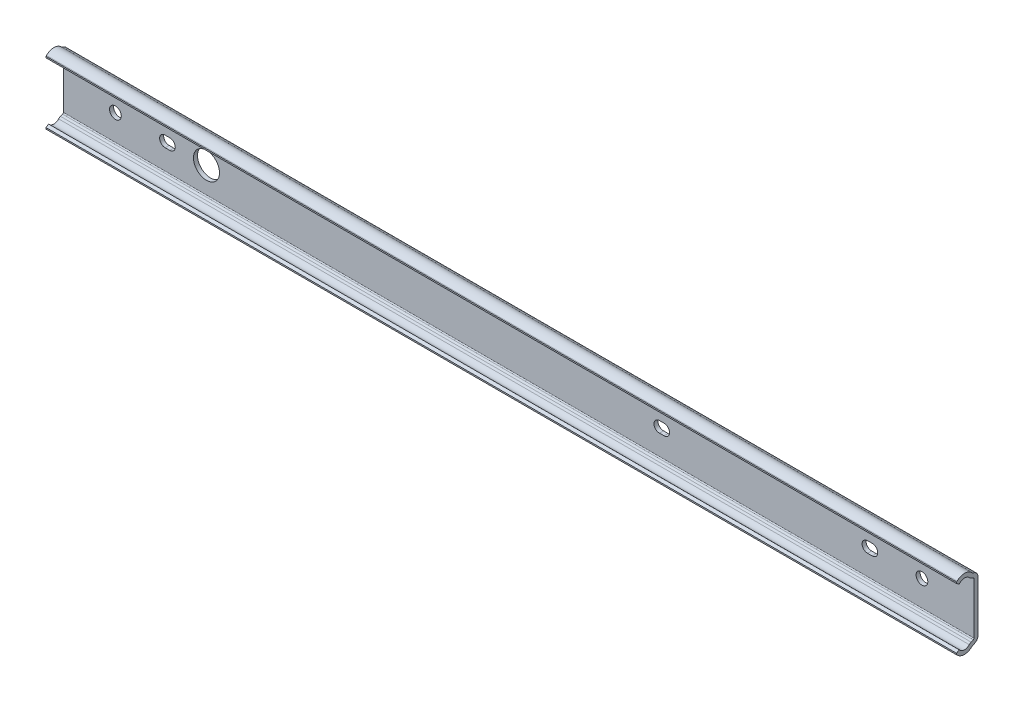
ISO-10303-21;
HEADER;
FILE_DESCRIPTION(('STEP AP214'),'2;1');
FILE_NAME('part.step','',(''),(''),'','','');
FILE_SCHEMA(('AUTOMOTIVE_DESIGN { 1 0 10303 214 1 1 1 1 }'));
ENDSEC;
DATA;
#1=APPLICATION_CONTEXT('core data for automotive mechanical design processes');
#2=APPLICATION_PROTOCOL_DEFINITION('international standard','automotive_design',2000,#1);
#3=PRODUCT_CONTEXT('',#1,'mechanical');
#4=PRODUCT('Part','Part','',(#3));
#5=PRODUCT_RELATED_PRODUCT_CATEGORY('part','',(#4));
#6=PRODUCT_DEFINITION_FORMATION('','',#4);
#7=PRODUCT_DEFINITION_CONTEXT('part definition',#1,'design');
#8=PRODUCT_DEFINITION('design','',#6,#7);
#9=PRODUCT_DEFINITION_SHAPE('','',#8);
#10=(LENGTH_UNIT() NAMED_UNIT(*) SI_UNIT(.MILLI.,.METRE.));
#11=(NAMED_UNIT(*) PLANE_ANGLE_UNIT() SI_UNIT($,.RADIAN.));
#12=(NAMED_UNIT(*) SI_UNIT($,.STERADIAN.) SOLID_ANGLE_UNIT());
#13=UNCERTAINTY_MEASURE_WITH_UNIT(LENGTH_MEASURE(1.E-05),#10,'distance_accuracy_value','');
#14=(GEOMETRIC_REPRESENTATION_CONTEXT(3) GLOBAL_UNCERTAINTY_ASSIGNED_CONTEXT((#13)) GLOBAL_UNIT_ASSIGNED_CONTEXT((#10,
#11,#12)) REPRESENTATION_CONTEXT('',''));
#15=CARTESIAN_POINT('',(0.,0.,0.));
#16=DIRECTION('',(0.,0.,1.));
#17=DIRECTION('',(1.,0.,0.));
#18=AXIS2_PLACEMENT_3D('',#15,#16,#17);
#19=CARTESIAN_POINT('',(-20.,-9.85313472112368,0.));
#20=DIRECTION('',(0.,0.,1.));
#21=DIRECTION('',(1.,0.,0.));
#22=AXIS2_PLACEMENT_3D('',#19,#20,#21);
#23=PLANE('',#22);
#24=DIRECTION('',(-1.,0.,0.));
#25=VECTOR('',#24,1.);
#26=CARTESIAN_POINT('',(-20.,2.09999977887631,0.));
#27=LINE('',#26,#25);
#28=CARTESIAN_POINT('',(290.9,2.09999977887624,0.));
#29=VERTEX_POINT('',#28);
#30=CARTESIAN_POINT('',(289.1,2.09999977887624,0.));
#31=VERTEX_POINT('',#30);
#32=EDGE_CURVE('E291',#29,#31,#27,.T.);
#33=ORIENTED_EDGE('',*,*,#32,.T.);
#34=CARTESIAN_POINT('',(289.1,-2.21123763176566E-07,0.));
#35=DIRECTION('',(0.,0.,1.));
#36=DIRECTION('',(1.,0.,0.));
#37=AXIS2_PLACEMENT_3D('',#34,#35,#36);
#38=CIRCLE('',#37,2.1);
#39=CARTESIAN_POINT('',(289.1,-2.10000022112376,0.));
#40=VERTEX_POINT('',#39);
#41=EDGE_CURVE('E294',#31,#40,#38,.T.);
#42=ORIENTED_EDGE('',*,*,#41,.T.);
#43=DIRECTION('',(1.,0.,0.));
#44=VECTOR('',#43,1.);
#45=CARTESIAN_POINT('',(-20.,-2.10000022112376,0.));
#46=LINE('',#45,#44);
#47=CARTESIAN_POINT('',(290.9,-2.10000022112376,0.));
#48=VERTEX_POINT('',#47);
#49=EDGE_CURVE('E286',#40,#48,#46,.T.);
#50=ORIENTED_EDGE('',*,*,#49,.T.);
#51=CARTESIAN_POINT('',(290.9,-2.21123763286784E-07,0.));
#52=DIRECTION('',(0.,0.,1.));
#53=DIRECTION('',(1.,0.,0.));
#54=AXIS2_PLACEMENT_3D('',#51,#52,#53);
#55=CIRCLE('',#54,2.1);
#56=EDGE_CURVE('E266',#48,#29,#55,.T.);
#57=ORIENTED_EDGE('',*,*,#56,.T.);
#58=EDGE_LOOP('',(#33,#42,#50,#57));
#59=FACE_BOUND('',#58,.T.);
#60=DIRECTION('',(1.,0.,0.));
#61=VECTOR('',#60,1.);
#62=CARTESIAN_POINT('',(-20.,-9.85313472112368,0.));
#63=LINE('',#62,#61);
#64=CARTESIAN_POINT('',(-20.,-9.85313472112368,0.));
#65=VERTEX_POINT('',#64);
#66=CARTESIAN_POINT('',(330.,-9.85313472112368,0.));
#67=VERTEX_POINT('',#66);
#68=EDGE_CURVE('E502',#65,#67,#63,.T.);
#69=ORIENTED_EDGE('',*,*,#68,.F.);
#70=DIRECTION('',(0.,-1.,0.));
#71=VECTOR('',#70,1.);
#72=CARTESIAN_POINT('',(-20.,-9.85313472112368,0.));
#73=LINE('',#72,#71);
#74=CARTESIAN_POINT('',(-20.,9.85313427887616,0.));
#75=VERTEX_POINT('',#74);
#76=EDGE_CURVE('E420',#75,#65,#73,.T.);
#77=ORIENTED_EDGE('',*,*,#76,.F.);
#78=DIRECTION('',(1.,0.,0.));
#79=VECTOR('',#78,1.);
#80=CARTESIAN_POINT('',(-20.,9.85313427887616,0.));
#81=LINE('',#80,#79);
#82=CARTESIAN_POINT('',(330.,9.85313427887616,0.));
#83=VERTEX_POINT('',#82);
#84=EDGE_CURVE('E505',#75,#83,#81,.T.);
#85=ORIENTED_EDGE('',*,*,#84,.T.);
#86=DIRECTION('',(0.,-1.,0.));
#87=VECTOR('',#86,1.);
#88=CARTESIAN_POINT('',(330.,-9.85313472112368,0.));
#89=LINE('',#88,#87);
#90=EDGE_CURVE('E367',#83,#67,#89,.T.);
#91=ORIENTED_EDGE('',*,*,#90,.T.);
#92=EDGE_LOOP('',(#69,#77,#85,#91));
#93=FACE_BOUND('',#92,.T.);
#94=CARTESIAN_POINT('',(35.,0.,0.));
#95=DIRECTION('',(0.,0.,-1.));
#96=DIRECTION('',(-1.,0.,0.));
#97=AXIS2_PLACEMENT_3D('',#94,#95,#96);
#98=CIRCLE('',#97,5.);
#99=CARTESIAN_POINT('',(30.,0.,0.));
#100=VERTEX_POINT('',#99);
#101=EDGE_CURVE('E297',#100,#100,#98,.T.);
#102=ORIENTED_EDGE('',*,*,#101,.F.);
#103=EDGE_LOOP('',(#102));
#104=FACE_BOUND('',#103,.T.);
#105=DIRECTION('',(-1.,0.,0.));
#106=VECTOR('',#105,1.);
#107=CARTESIAN_POINT('',(20.9,-2.1,0.));
#108=LINE('',#107,#106);
#109=CARTESIAN_POINT('',(20.9,-2.1,0.));
#110=VERTEX_POINT('',#109);
#111=CARTESIAN_POINT('',(19.1,-2.1,0.));
#112=VERTEX_POINT('',#111);
#113=EDGE_CURVE('E302',#110,#112,#108,.T.);
#114=ORIENTED_EDGE('',*,*,#113,.F.);
#115=CARTESIAN_POINT('',(20.9,0.,0.));
#116=DIRECTION('',(0.,0.,-1.));
#117=DIRECTION('',(-1.,0.,0.));
#118=AXIS2_PLACEMENT_3D('',#115,#116,#117);
#119=CIRCLE('',#118,2.1);
#120=CARTESIAN_POINT('',(20.9,2.1,0.));
#121=VERTEX_POINT('',#120);
#122=EDGE_CURVE('E300',#121,#110,#119,.T.);
#123=ORIENTED_EDGE('',*,*,#122,.F.);
#124=DIRECTION('',(1.,0.,0.));
#125=VECTOR('',#124,1.);
#126=CARTESIAN_POINT('',(20.9,2.1,0.));
#127=LINE('',#126,#125);
#128=CARTESIAN_POINT('',(19.1,2.1,0.));
#129=VERTEX_POINT('',#128);
#130=EDGE_CURVE('E308',#129,#121,#127,.T.);
#131=ORIENTED_EDGE('',*,*,#130,.F.);
#132=CARTESIAN_POINT('',(19.1,0.,0.));
#133=DIRECTION('',(0.,0.,-1.));
#134=DIRECTION('',(-1.,0.,0.));
#135=AXIS2_PLACEMENT_3D('',#132,#133,#134);
#136=CIRCLE('',#135,2.1);
#137=EDGE_CURVE('E305',#112,#129,#136,.T.);
#138=ORIENTED_EDGE('',*,*,#137,.F.);
#139=EDGE_LOOP('',(#114,#123,#131,#138));
#140=FACE_BOUND('',#139,.T.);
#141=DIRECTION('',(-1.,0.,0.));
#142=VECTOR('',#141,1.);
#143=CARTESIAN_POINT('',(210.9,-2.1,0.));
#144=LINE('',#143,#142);
#145=CARTESIAN_POINT('',(210.9,-2.1,0.));
#146=VERTEX_POINT('',#145);
#147=CARTESIAN_POINT('',(209.1,-2.1,0.));
#148=VERTEX_POINT('',#147);
#149=EDGE_CURVE('E322',#146,#148,#144,.T.);
#150=ORIENTED_EDGE('',*,*,#149,.F.);
#151=CARTESIAN_POINT('',(210.9,0.,0.));
#152=DIRECTION('',(0.,0.,-1.));
#153=DIRECTION('',(-1.,0.,0.));
#154=AXIS2_PLACEMENT_3D('',#151,#152,#153);
#155=CIRCLE('',#154,2.1);
#156=CARTESIAN_POINT('',(210.9,2.09999999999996,0.));
#157=VERTEX_POINT('',#156);
#158=EDGE_CURVE('E314',#157,#146,#155,.T.);
#159=ORIENTED_EDGE('',*,*,#158,.F.);
#160=DIRECTION('',(1.,0.,0.));
#161=VECTOR('',#160,1.);
#162=CARTESIAN_POINT('',(210.9,2.09999999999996,0.));
#163=LINE('',#162,#161);
#164=CARTESIAN_POINT('',(209.1,2.09999999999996,0.));
#165=VERTEX_POINT('',#164);
#166=EDGE_CURVE('E328',#165,#157,#163,.T.);
#167=ORIENTED_EDGE('',*,*,#166,.F.);
#168=CARTESIAN_POINT('',(209.1,0.,0.));
#169=DIRECTION('',(0.,0.,-1.));
#170=DIRECTION('',(-1.,0.,0.));
#171=AXIS2_PLACEMENT_3D('',#168,#169,#170);
#172=CIRCLE('',#171,2.1);
#173=EDGE_CURVE('E325',#148,#165,#172,.T.);
#174=ORIENTED_EDGE('',*,*,#173,.F.);
#175=EDGE_LOOP('',(#150,#159,#167,#174));
#176=FACE_BOUND('',#175,.T.);
#177=CARTESIAN_POINT('',(0.,0.,0.));
#178=DIRECTION('',(0.,0.,-1.));
#179=DIRECTION('',(-1.,0.,0.));
#180=AXIS2_PLACEMENT_3D('',#177,#178,#179);
#181=CIRCLE('',#180,2.24999999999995);
#182=CARTESIAN_POINT('',(-2.24999999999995,0.,0.));
#183=VERTEX_POINT('',#182);
#184=EDGE_CURVE('E334',#183,#183,#181,.T.);
#185=ORIENTED_EDGE('',*,*,#184,.F.);
#186=EDGE_LOOP('',(#185));
#187=FACE_BOUND('',#186,.T.);
#188=CARTESIAN_POINT('',(310.,0.,0.));
#189=DIRECTION('',(0.,0.,-1.));
#190=DIRECTION('',(-1.,0.,0.));
#191=AXIS2_PLACEMENT_3D('',#188,#189,#190);
#192=CIRCLE('',#191,2.25);
#193=CARTESIAN_POINT('',(307.75,0.,0.));
#194=VERTEX_POINT('',#193);
#195=EDGE_CURVE('E344',#194,#194,#192,.T.);
#196=ORIENTED_EDGE('',*,*,#195,.F.);
#197=EDGE_LOOP('',(#196));
#198=FACE_BOUND('',#197,.T.);
#199=ADVANCED_FACE('F14',(#59,#93,#104,#140,#176,#187,#198),#23,.F.);
#200=CARTESIAN_POINT('',(-20.,-9.85313472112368,1.54999999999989));
#201=DIRECTION('',(0.,0.,-1.));
#202=DIRECTION('',(-1.,0.,0.));
#203=AXIS2_PLACEMENT_3D('',#200,#201,#202);
#204=PLANE('',#203);
#205=DIRECTION('',(1.,0.,0.));
#206=VECTOR('',#205,1.);
#207=CARTESIAN_POINT('',(289.1,-2.10000022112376,1.54999999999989));
#208=LINE('',#207,#206);
#209=CARTESIAN_POINT('',(289.1,-2.10000022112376,1.54999999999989));
#210=VERTEX_POINT('',#209);
#211=CARTESIAN_POINT('',(290.9,-2.10000022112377,1.54999999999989));
#212=VERTEX_POINT('',#211);
#213=EDGE_CURVE('E272',#210,#212,#208,.T.);
#214=ORIENTED_EDGE('',*,*,#213,.F.);
#215=CARTESIAN_POINT('',(289.1,-2.21123763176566E-07,1.54999999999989));
#216=DIRECTION('',(0.,0.,1.));
#217=DIRECTION('',(1.,0.,0.));
#218=AXIS2_PLACEMENT_3D('',#215,#216,#217);
#219=CIRCLE('',#218,2.1);
#220=CARTESIAN_POINT('',(289.1,2.09999977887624,1.54999999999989));
#221=VERTEX_POINT('',#220);
#222=EDGE_CURVE('E38',#221,#210,#219,.T.);
#223=ORIENTED_EDGE('',*,*,#222,.F.);
#224=DIRECTION('',(-1.,0.,0.));
#225=VECTOR('',#224,1.);
#226=CARTESIAN_POINT('',(289.1,2.09999977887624,1.54999999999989));
#227=LINE('',#226,#225);
#228=CARTESIAN_POINT('',(290.9,2.09999977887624,1.54999999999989));
#229=VERTEX_POINT('',#228);
#230=EDGE_CURVE('E279',#229,#221,#227,.T.);
#231=ORIENTED_EDGE('',*,*,#230,.F.);
#232=CARTESIAN_POINT('',(290.9,-2.21123763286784E-07,1.54999999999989));
#233=DIRECTION('',(0.,0.,1.));
#234=DIRECTION('',(1.,0.,0.));
#235=AXIS2_PLACEMENT_3D('',#232,#233,#234);
#236=CIRCLE('',#235,2.1);
#237=EDGE_CURVE('E263',#212,#229,#236,.T.);
#238=ORIENTED_EDGE('',*,*,#237,.F.);
#239=EDGE_LOOP('',(#214,#223,#231,#238));
#240=FACE_BOUND('',#239,.T.);
#241=CARTESIAN_POINT('',(35.,0.,1.54999999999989));
#242=DIRECTION('',(0.,0.,-1.));
#243=DIRECTION('',(-1.,0.,0.));
#244=AXIS2_PLACEMENT_3D('',#241,#242,#243);
#245=CIRCLE('',#244,5.);
#246=CARTESIAN_POINT('',(30.,0.,1.54999999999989));
#247=VERTEX_POINT('',#246);
#248=EDGE_CURVE('E18',#247,#247,#245,.T.);
#249=ORIENTED_EDGE('',*,*,#248,.T.);
#250=EDGE_LOOP('',(#249));
#251=FACE_BOUND('',#250,.T.);
#252=DIRECTION('',(1.,0.,0.));
#253=VECTOR('',#252,1.);
#254=CARTESIAN_POINT('',(-20.,2.1,1.54999999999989));
#255=LINE('',#254,#253);
#256=CARTESIAN_POINT('',(19.1,2.1,1.54999999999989));
#257=VERTEX_POINT('',#256);
#258=CARTESIAN_POINT('',(20.9,2.1,1.54999999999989));
#259=VERTEX_POINT('',#258);
#260=EDGE_CURVE('E23',#257,#259,#255,.T.);
#261=ORIENTED_EDGE('',*,*,#260,.T.);
#262=CARTESIAN_POINT('',(20.9,0.,1.54999999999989));
#263=DIRECTION('',(0.,0.,-1.));
#264=DIRECTION('',(-1.,0.,0.));
#265=AXIS2_PLACEMENT_3D('',#262,#263,#264);
#266=CIRCLE('',#265,2.1);
#267=CARTESIAN_POINT('',(20.9,-2.1,1.54999999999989));
#268=VERTEX_POINT('',#267);
#269=EDGE_CURVE('E9',#259,#268,#266,.T.);
#270=ORIENTED_EDGE('',*,*,#269,.T.);
#271=DIRECTION('',(-1.,0.,0.));
#272=VECTOR('',#271,1.);
#273=CARTESIAN_POINT('',(-20.,-2.1,1.54999999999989));
#274=LINE('',#273,#272);
#275=CARTESIAN_POINT('',(19.1,-2.1,1.54999999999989));
#276=VERTEX_POINT('',#275);
#277=EDGE_CURVE('E548',#268,#276,#274,.T.);
#278=ORIENTED_EDGE('',*,*,#277,.T.);
#279=CARTESIAN_POINT('',(19.1,0.,1.54999999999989));
#280=DIRECTION('',(0.,0.,-1.));
#281=DIRECTION('',(-1.,0.,0.));
#282=AXIS2_PLACEMENT_3D('',#279,#280,#281);
#283=CIRCLE('',#282,2.1);
#284=EDGE_CURVE('E551',#276,#257,#283,.T.);
#285=ORIENTED_EDGE('',*,*,#284,.T.);
#286=EDGE_LOOP('',(#261,#270,#278,#285));
#287=FACE_BOUND('',#286,.T.);
#288=DIRECTION('',(1.,0.,0.));
#289=VECTOR('',#288,1.);
#290=CARTESIAN_POINT('',(-20.,2.09999999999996,1.54999999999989));
#291=LINE('',#290,#289);
#292=CARTESIAN_POINT('',(209.1,2.09999999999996,1.54999999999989));
#293=VERTEX_POINT('',#292);
#294=CARTESIAN_POINT('',(210.9,2.09999999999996,1.54999999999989));
#295=VERTEX_POINT('',#294);
#296=EDGE_CURVE('E542',#293,#295,#291,.T.);
#297=ORIENTED_EDGE('',*,*,#296,.T.);
#298=CARTESIAN_POINT('',(210.9,0.,1.54999999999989));
#299=DIRECTION('',(0.,0.,-1.));
#300=DIRECTION('',(-1.,0.,0.));
#301=AXIS2_PLACEMENT_3D('',#298,#299,#300);
#302=CIRCLE('',#301,2.1);
#303=CARTESIAN_POINT('',(210.9,-2.1,1.54999999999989));
#304=VERTEX_POINT('',#303);
#305=EDGE_CURVE('E545',#295,#304,#302,.T.);
#306=ORIENTED_EDGE('',*,*,#305,.T.);
#307=DIRECTION('',(-1.,0.,0.));
#308=VECTOR('',#307,1.);
#309=CARTESIAN_POINT('',(-20.,-2.1,1.54999999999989));
#310=LINE('',#309,#308);
#311=CARTESIAN_POINT('',(209.1,-2.1,1.54999999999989));
#312=VERTEX_POINT('',#311);
#313=EDGE_CURVE('E532',#304,#312,#310,.T.);
#314=ORIENTED_EDGE('',*,*,#313,.T.);
#315=CARTESIAN_POINT('',(209.1,0.,1.54999999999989));
#316=DIRECTION('',(0.,0.,-1.));
#317=DIRECTION('',(-1.,0.,0.));
#318=AXIS2_PLACEMENT_3D('',#315,#316,#317);
#319=CIRCLE('',#318,2.1);
#320=EDGE_CURVE('E539',#312,#293,#319,.T.);
#321=ORIENTED_EDGE('',*,*,#320,.T.);
#322=EDGE_LOOP('',(#297,#306,#314,#321));
#323=FACE_BOUND('',#322,.T.);
#324=CARTESIAN_POINT('',(0.,0.,1.54999999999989));
#325=DIRECTION('',(0.,0.,-1.));
#326=DIRECTION('',(-1.,0.,0.));
#327=AXIS2_PLACEMENT_3D('',#324,#325,#326);
#328=CIRCLE('',#327,2.24999999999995);
#329=CARTESIAN_POINT('',(-2.24999999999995,0.,1.54999999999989));
#330=VERTEX_POINT('',#329);
#331=EDGE_CURVE('E343',#330,#330,#328,.T.);
#332=ORIENTED_EDGE('',*,*,#331,.T.);
#333=EDGE_LOOP('',(#332));
#334=FACE_BOUND('',#333,.T.);
#335=CARTESIAN_POINT('',(310.,0.,1.54999999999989));
#336=DIRECTION('',(0.,0.,-1.));
#337=DIRECTION('',(-1.,0.,0.));
#338=AXIS2_PLACEMENT_3D('',#335,#336,#337);
#339=CIRCLE('',#338,2.25);
#340=CARTESIAN_POINT('',(307.75,0.,1.54999999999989));
#341=VERTEX_POINT('',#340);
#342=EDGE_CURVE('E347',#341,#341,#339,.T.);
#343=ORIENTED_EDGE('',*,*,#342,.T.);
#344=EDGE_LOOP('',(#343));
#345=FACE_BOUND('',#344,.T.);
#346=DIRECTION('',(1.,0.,0.));
#347=VECTOR('',#346,1.);
#348=CARTESIAN_POINT('',(-20.,9.85313427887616,1.54999999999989));
#349=LINE('',#348,#347);
#350=CARTESIAN_POINT('',(-20.,9.85313427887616,1.54999999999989));
#351=VERTEX_POINT('',#350);
#352=CARTESIAN_POINT('',(330.,9.85313427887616,1.54999999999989));
#353=VERTEX_POINT('',#352);
#354=EDGE_CURVE('E463',#351,#353,#349,.T.);
#355=ORIENTED_EDGE('',*,*,#354,.F.);
#356=DIRECTION('',(0.,1.,0.));
#357=VECTOR('',#356,1.);
#358=CARTESIAN_POINT('',(-20.,-9.85313472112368,1.54999999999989));
#359=LINE('',#358,#357);
#360=CARTESIAN_POINT('',(-20.,-9.85313472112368,1.54999999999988));
#361=VERTEX_POINT('',#360);
#362=EDGE_CURVE('E446',#361,#351,#359,.T.);
#363=ORIENTED_EDGE('',*,*,#362,.F.);
#364=DIRECTION('',(1.,0.,0.));
#365=VECTOR('',#364,1.);
#366=CARTESIAN_POINT('',(-20.,-9.85313472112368,1.54999999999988));
#367=LINE('',#366,#365);
#368=CARTESIAN_POINT('',(330.,-9.85313472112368,1.54999999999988));
#369=VERTEX_POINT('',#368);
#370=EDGE_CURVE('E466',#361,#369,#367,.T.);
#371=ORIENTED_EDGE('',*,*,#370,.T.);
#372=DIRECTION('',(0.,1.,0.));
#373=VECTOR('',#372,1.);
#374=CARTESIAN_POINT('',(330.,-9.85313472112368,1.54999999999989));
#375=LINE('',#374,#373);
#376=EDGE_CURVE('E393',#369,#353,#375,.T.);
#377=ORIENTED_EDGE('',*,*,#376,.T.);
#378=EDGE_LOOP('',(#355,#363,#371,#377));
#379=FACE_BOUND('',#378,.T.);
#380=ADVANCED_FACE('F276',(#240,#251,#287,#323,#334,#345,#379),#204,.F.);
#381=CARTESIAN_POINT('',(-20.,9.47,5.19000063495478));
#382=DIRECTION('',(-1.,0.,0.));
#383=DIRECTION('',(0.,0.,1.));
#384=AXIS2_PLACEMENT_3D('',#381,#382,#383);
#385=PLANE('',#384);
#386=ORIENTED_EDGE('',*,*,#362,.T.);
#387=CARTESIAN_POINT('',(-20.,9.85313427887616,2.05000034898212));
#388=DIRECTION('',(1.,0.,0.));
#389=DIRECTION('',(0.,0.,1.));
#390=AXIS2_PLACEMENT_3D('',#387,#388,#389);
#391=CIRCLE('',#390,0.500000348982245);
#392=CARTESIAN_POINT('',(-20.,10.3133869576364,1.85463448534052));
#393=VERTEX_POINT('',#392);
#394=EDGE_CURVE('E448',#351,#393,#391,.T.);
#395=ORIENTED_EDGE('',*,*,#394,.T.);
#396=DIRECTION('',(0.,0.39073096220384,0.920504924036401));
#397=VECTOR('',#396,1.);
#398=CARTESIAN_POINT('',(-20.,10.6566650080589,2.66334729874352));
#399=LINE('',#398,#397);
#400=CARTESIAN_POINT('',(-20.,10.6566650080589,2.66334729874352));
#401=VERTEX_POINT('',#400);
#402=EDGE_CURVE('E450',#393,#401,#399,.T.);
#403=ORIENTED_EDGE('',*,*,#402,.T.);
#404=CARTESIAN_POINT('',(-20.,12.5437002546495,1.86234835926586));
#405=DIRECTION('',(-1.,0.,0.));
#406=DIRECTION('',(0.,0.,1.));
#407=AXIS2_PLACEMENT_3D('',#404,#405,#406);
#408=CIRCLE('',#407,2.05000032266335);
#409=CARTESIAN_POINT('',(-20.,11.152732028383,3.36823969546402));
#410=VERTEX_POINT('',#409);
#411=EDGE_CURVE('E452',#401,#410,#408,.T.);
#412=ORIENTED_EDGE('',*,*,#411,.T.);
#413=CARTESIAN_POINT('',(-20.,9.47,5.19000063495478));
#414=DIRECTION('',(1.,0.,0.));
#415=DIRECTION('',(0.,0.,1.));
#416=AXIS2_PLACEMENT_3D('',#413,#414,#415);
#417=CIRCLE('',#416,2.48);
#418=CARTESIAN_POINT('',(-20.,11.2236248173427,6.94362545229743));
#419=VERTEX_POINT('',#418);
#420=EDGE_CURVE('E401',#410,#419,#417,.T.);
#421=ORIENTED_EDGE('',*,*,#420,.T.);
#422=DIRECTION('',(0.,-0.707107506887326,0.707106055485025));
#423=VECTOR('',#422,1.);
#424=CARTESIAN_POINT('',(-20.,11.2236248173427,6.94362545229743));
#425=LINE('',#424,#423);
#426=CARTESIAN_POINT('',(-20.,10.914413,7.2528366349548));
#427=VERTEX_POINT('',#426);
#428=EDGE_CURVE('E404',#419,#427,#425,.T.);
#429=ORIENTED_EDGE('',*,*,#428,.T.);
#430=DIRECTION('',(0.,0.573576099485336,0.819152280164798));
#431=VECTOR('',#430,1.);
#432=CARTESIAN_POINT('',(-20.,10.914413,7.2528366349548));
#433=LINE('',#432,#431);
#434=CARTESIAN_POINT('',(-20.,11.59863,8.23000063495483));
#435=VERTEX_POINT('',#434);
#436=EDGE_CURVE('E406',#427,#435,#433,.T.);
#437=ORIENTED_EDGE('',*,*,#436,.T.);
#438=DIRECTION('',(0.,1.,-2.09219452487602E-13));
#439=VECTOR('',#438,1.);
#440=CARTESIAN_POINT('',(-20.,12.1292799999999,8.23000063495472));
#441=LINE('',#440,#439);
#442=CARTESIAN_POINT('',(-20.,12.1292799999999,8.23000063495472));
#443=VERTEX_POINT('',#442);
#444=EDGE_CURVE('E408',#435,#443,#441,.T.);
#445=ORIENTED_EDGE('',*,*,#444,.T.);
#446=DIRECTION('',(0.,0.707108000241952,-0.707105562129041));
#447=VECTOR('',#446,1.);
#448=CARTESIAN_POINT('',(-20.,12.3196403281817,8.03964096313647));
#449=LINE('',#448,#447);
#450=CARTESIAN_POINT('',(-20.,12.3196403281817,8.03964096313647));
#451=VERTEX_POINT('',#450);
#452=EDGE_CURVE('E410',#443,#451,#449,.T.);
#453=ORIENTED_EDGE('',*,*,#452,.T.);
#454=CARTESIAN_POINT('',(-20.,9.47,5.19000063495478));
#455=DIRECTION('',(-1.,0.,0.));
#456=DIRECTION('',(0.,0.,1.));
#457=AXIS2_PLACEMENT_3D('',#454,#455,#456);
#458=CIRCLE('',#457,4.02999999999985);
#459=CARTESIAN_POINT('',(-20.,12.2044395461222,2.22963910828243));
#460=VERTEX_POINT('',#459);
#461=EDGE_CURVE('E412',#451,#460,#458,.T.);
#462=ORIENTED_EDGE('',*,*,#461,.T.);
#463=CARTESIAN_POINT('',(-20.,12.5437002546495,1.86234835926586));
#464=DIRECTION('',(1.,0.,0.));
#465=DIRECTION('',(0.,0.,1.));
#466=AXIS2_PLACEMENT_3D('',#463,#464,#465);
#467=CIRCLE('',#466,0.500000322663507);
#468=CARTESIAN_POINT('',(-20.,12.0834476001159,2.05771421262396));
#469=VERTEX_POINT('',#468);
#470=EDGE_CURVE('E414',#460,#469,#467,.T.);
#471=ORIENTED_EDGE('',*,*,#470,.T.);
#472=DIRECTION('',(0.,-0.39073096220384,-0.920504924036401));
#473=VECTOR('',#472,1.);
#474=CARTESIAN_POINT('',(-20.,12.0834476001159,2.05771421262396));
#475=LINE('',#474,#473);
#476=CARTESIAN_POINT('',(-20.,11.7401695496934,1.24900139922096));
#477=VERTEX_POINT('',#476);
#478=EDGE_CURVE('E416',#469,#477,#475,.T.);
#479=ORIENTED_EDGE('',*,*,#478,.T.);
#480=CARTESIAN_POINT('',(-20.,9.85313427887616,2.05000034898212));
#481=DIRECTION('',(-1.,0.,0.));
#482=DIRECTION('',(0.,0.,1.));
#483=AXIS2_PLACEMENT_3D('',#480,#481,#482);
#484=CIRCLE('',#483,2.05000034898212);
#485=EDGE_CURVE('E418',#477,#75,#484,.T.);
#486=ORIENTED_EDGE('',*,*,#485,.T.);
#487=ORIENTED_EDGE('',*,*,#76,.T.);
#488=CARTESIAN_POINT('',(-20.,-9.85313472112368,2.05000034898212));
#489=DIRECTION('',(-1.,0.,0.));
#490=DIRECTION('',(0.,0.,-1.));
#491=AXIS2_PLACEMENT_3D('',#488,#489,#490);
#492=CIRCLE('',#491,2.05000034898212);
#493=CARTESIAN_POINT('',(-20.,-11.7401699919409,1.24900139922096));
#494=VERTEX_POINT('',#493);
#495=EDGE_CURVE('E422',#65,#494,#492,.T.);
#496=ORIENTED_EDGE('',*,*,#495,.T.);
#497=DIRECTION('',(0.,-0.39073096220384,0.920504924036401));
#498=VECTOR('',#497,1.);
#499=CARTESIAN_POINT('',(-20.,-12.0834480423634,2.05771421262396));
#500=LINE('',#499,#498);
#501=CARTESIAN_POINT('',(-20.,-12.0834480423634,2.05771421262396));
#502=VERTEX_POINT('',#501);
#503=EDGE_CURVE('E424',#494,#502,#500,.T.);
#504=ORIENTED_EDGE('',*,*,#503,.T.);
#505=CARTESIAN_POINT('',(-20.,-12.5437006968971,1.86234835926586));
#506=DIRECTION('',(1.,0.,0.));
#507=DIRECTION('',(0.,0.,-1.));
#508=AXIS2_PLACEMENT_3D('',#505,#506,#507);
#509=CIRCLE('',#508,0.500000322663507);
#510=CARTESIAN_POINT('',(-20.,-12.2044399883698,2.22963910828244));
#511=VERTEX_POINT('',#510);
#512=EDGE_CURVE('E426',#502,#511,#509,.T.);
#513=ORIENTED_EDGE('',*,*,#512,.T.);
#514=CARTESIAN_POINT('',(-20.,-9.47000044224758,5.19000063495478));
#515=DIRECTION('',(-1.,0.,0.));
#516=DIRECTION('',(0.,0.,-1.));
#517=AXIS2_PLACEMENT_3D('',#514,#515,#516);
#518=CIRCLE('',#517,4.02999999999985);
#519=CARTESIAN_POINT('',(-20.,-12.3196407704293,8.03964096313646));
#520=VERTEX_POINT('',#519);
#521=EDGE_CURVE('E428',#511,#520,#518,.T.);
#522=ORIENTED_EDGE('',*,*,#521,.T.);
#523=DIRECTION('',(0.,0.707108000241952,0.707105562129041));
#524=VECTOR('',#523,1.);
#525=CARTESIAN_POINT('',(-20.,-12.3196407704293,8.03964096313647));
#526=LINE('',#525,#524);
#527=CARTESIAN_POINT('',(-20.,-12.1292804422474,8.23000063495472));
#528=VERTEX_POINT('',#527);
#529=EDGE_CURVE('E430',#520,#528,#526,.T.);
#530=ORIENTED_EDGE('',*,*,#529,.T.);
#531=DIRECTION('',(0.,1.,2.09219452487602E-13));
#532=VECTOR('',#531,1.);
#533=CARTESIAN_POINT('',(-20.,-12.1292804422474,8.23000063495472));
#534=LINE('',#533,#532);
#535=CARTESIAN_POINT('',(-20.,-11.5986304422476,8.23000063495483));
#536=VERTEX_POINT('',#535);
#537=EDGE_CURVE('E432',#528,#536,#534,.T.);
#538=ORIENTED_EDGE('',*,*,#537,.T.);
#539=DIRECTION('',(0.,0.573576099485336,-0.819152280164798));
#540=VECTOR('',#539,1.);
#541=CARTESIAN_POINT('',(-20.,-10.9144134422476,7.2528366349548));
#542=LINE('',#541,#540);
#543=CARTESIAN_POINT('',(-20.,-10.9144134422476,7.2528366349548));
#544=VERTEX_POINT('',#543);
#545=EDGE_CURVE('E434',#536,#544,#542,.T.);
#546=ORIENTED_EDGE('',*,*,#545,.T.);
#547=DIRECTION('',(0.,-0.707107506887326,-0.707106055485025));
#548=VECTOR('',#547,1.);
#549=CARTESIAN_POINT('',(-20.,-11.2236252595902,6.94362545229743));
#550=LINE('',#549,#548);
#551=CARTESIAN_POINT('',(-20.,-11.2236252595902,6.94362545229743));
#552=VERTEX_POINT('',#551);
#553=EDGE_CURVE('E436',#544,#552,#550,.T.);
#554=ORIENTED_EDGE('',*,*,#553,.T.);
#555=CARTESIAN_POINT('',(-20.,-9.47000044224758,5.19000063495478));
#556=DIRECTION('',(1.,0.,0.));
#557=DIRECTION('',(0.,0.,-1.));
#558=AXIS2_PLACEMENT_3D('',#555,#556,#557);
#559=CIRCLE('',#558,2.48);
#560=CARTESIAN_POINT('',(-20.,-11.1527324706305,3.36823969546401));
#561=VERTEX_POINT('',#560);
#562=EDGE_CURVE('E438',#552,#561,#559,.T.);
#563=ORIENTED_EDGE('',*,*,#562,.T.);
#564=CARTESIAN_POINT('',(-20.,-12.5437006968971,1.86234835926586));
#565=DIRECTION('',(-1.,0.,0.));
#566=DIRECTION('',(0.,0.,-1.));
#567=AXIS2_PLACEMENT_3D('',#564,#565,#566);
#568=CIRCLE('',#567,2.05000032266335);
#569=CARTESIAN_POINT('',(-20.,-10.6566654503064,2.66334729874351));
#570=VERTEX_POINT('',#569);
#571=EDGE_CURVE('E440',#561,#570,#568,.T.);
#572=ORIENTED_EDGE('',*,*,#571,.T.);
#573=DIRECTION('',(0.,0.39073096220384,-0.920504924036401));
#574=VECTOR('',#573,1.);
#575=CARTESIAN_POINT('',(-20.,-10.6566654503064,2.66334729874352));
#576=LINE('',#575,#574);
#577=CARTESIAN_POINT('',(-20.,-10.3133873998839,1.85463448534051));
#578=VERTEX_POINT('',#577);
#579=EDGE_CURVE('E442',#570,#578,#576,.T.);
#580=ORIENTED_EDGE('',*,*,#579,.T.);
#581=CARTESIAN_POINT('',(-20.,-9.85313472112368,2.05000034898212));
#582=DIRECTION('',(1.,0.,0.));
#583=DIRECTION('',(0.,0.,-1.));
#584=AXIS2_PLACEMENT_3D('',#581,#582,#583);
#585=CIRCLE('',#584,0.500000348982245);
#586=EDGE_CURVE('E444',#578,#361,#585,.T.);
#587=ORIENTED_EDGE('',*,*,#586,.T.);
#588=EDGE_LOOP('',(#386,#395,#403,#412,#421,#429,#437,#445,#453,#462,#471,#479,#486,#487,#496,
#504,#513,#522,#530,#538,#546,#554,#563,#572,#580,#587));
#589=FACE_BOUND('',#588,.T.);
#590=ADVANCED_FACE('F596',(#589),#385,.T.);
#591=CARTESIAN_POINT('',(-20.,9.47,5.19000063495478));
#592=DIRECTION('',(1.,0.,0.));
#593=DIRECTION('',(0.,0.,-1.));
#594=AXIS2_PLACEMENT_3D('',#591,#592,#593);
#595=CYLINDRICAL_SURFACE('',#594,2.48);
#596=CARTESIAN_POINT('',(330.,9.47,5.19000063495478));
#597=DIRECTION('',(1.,0.,0.));
#598=DIRECTION('',(0.,0.,1.));
#599=AXIS2_PLACEMENT_3D('',#596,#597,#598);
#600=CIRCLE('',#599,2.48);
#601=CARTESIAN_POINT('',(330.,11.152732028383,3.36823969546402));
#602=VERTEX_POINT('',#601);
#603=CARTESIAN_POINT('',(330.,11.2236248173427,6.94362545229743));
#604=VERTEX_POINT('',#603);
#605=EDGE_CURVE('E348',#602,#604,#600,.T.);
#606=ORIENTED_EDGE('',*,*,#605,.T.);
#607=DIRECTION('',(1.,0.,0.));
#608=VECTOR('',#607,1.);
#609=CARTESIAN_POINT('',(-20.,11.2236248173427,6.94362545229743));
#610=LINE('',#609,#608);
#611=EDGE_CURVE('E529',#419,#604,#610,.T.);
#612=ORIENTED_EDGE('',*,*,#611,.F.);
#613=ORIENTED_EDGE('',*,*,#420,.F.);
#614=DIRECTION('',(1.,0.,0.));
#615=VECTOR('',#614,1.);
#616=CARTESIAN_POINT('',(-20.,11.152732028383,3.36823969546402));
#617=LINE('',#616,#615);
#618=EDGE_CURVE('E454',#410,#602,#617,.T.);
#619=ORIENTED_EDGE('',*,*,#618,.T.);
#620=EDGE_LOOP('',(#606,#612,#613,#619));
#621=FACE_BOUND('',#620,.T.);
#622=ADVANCED_FACE('F16',(#621),#595,.F.);
#623=CARTESIAN_POINT('',(-20.,11.2236248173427,6.94362545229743));
#624=DIRECTION('',(0.,0.707106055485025,0.707107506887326));
#625=DIRECTION('',(0.,0.707107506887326,-0.707106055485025));
#626=AXIS2_PLACEMENT_3D('',#623,#624,#625);
#627=PLANE('',#626);
#628=DIRECTION('',(0.,-0.707107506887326,0.707106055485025));
#629=VECTOR('',#628,1.);
#630=CARTESIAN_POINT('',(330.,11.2236248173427,6.94362545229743));
#631=LINE('',#630,#629);
#632=CARTESIAN_POINT('',(330.,10.914413,7.2528366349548));
#633=VERTEX_POINT('',#632);
#634=EDGE_CURVE('E351',#604,#633,#631,.T.);
#635=ORIENTED_EDGE('',*,*,#634,.T.);
#636=DIRECTION('',(1.,0.,0.));
#637=VECTOR('',#636,1.);
#638=CARTESIAN_POINT('',(-20.,10.914413,7.2528366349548));
#639=LINE('',#638,#637);
#640=EDGE_CURVE('E526',#427,#633,#639,.T.);
#641=ORIENTED_EDGE('',*,*,#640,.F.);
#642=ORIENTED_EDGE('',*,*,#428,.F.);
#643=ORIENTED_EDGE('',*,*,#611,.T.);
#644=EDGE_LOOP('',(#635,#641,#642,#643));
#645=FACE_BOUND('',#644,.T.);
#646=ADVANCED_FACE('F629',(#645),#627,.F.);
#647=CARTESIAN_POINT('',(-20.,10.914413,7.2528366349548));
#648=DIRECTION('',(0.,0.819152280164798,-0.573576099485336));
#649=DIRECTION('',(0.,-0.573576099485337,-0.819152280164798));
#650=AXIS2_PLACEMENT_3D('',#647,#648,#649);
#651=PLANE('',#650);
#652=DIRECTION('',(0.,0.573576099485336,0.819152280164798));
#653=VECTOR('',#652,1.);
#654=CARTESIAN_POINT('',(330.,10.914413,7.2528366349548));
#655=LINE('',#654,#653);
#656=CARTESIAN_POINT('',(330.,11.59863,8.23000063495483));
#657=VERTEX_POINT('',#656);
#658=EDGE_CURVE('E353',#633,#657,#655,.T.);
#659=ORIENTED_EDGE('',*,*,#658,.T.);
#660=DIRECTION('',(1.,0.,0.));
#661=VECTOR('',#660,1.);
#662=CARTESIAN_POINT('',(-20.,11.59863,8.23000063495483));
#663=LINE('',#662,#661);
#664=EDGE_CURVE('E523',#435,#657,#663,.T.);
#665=ORIENTED_EDGE('',*,*,#664,.F.);
#666=ORIENTED_EDGE('',*,*,#436,.F.);
#667=ORIENTED_EDGE('',*,*,#640,.T.);
#668=EDGE_LOOP('',(#659,#665,#666,#667));
#669=FACE_BOUND('',#668,.T.);
#670=ADVANCED_FACE('F626',(#669),#651,.F.);
#671=CARTESIAN_POINT('',(-20.,12.1292799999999,8.23000063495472));
#672=DIRECTION('',(0.,-2.09219452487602E-13,-1.));
#673=DIRECTION('',(0.,-1.,2.09219452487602E-13));
#674=AXIS2_PLACEMENT_3D('',#671,#672,#673);
#675=PLANE('',#674);
#676=DIRECTION('',(0.,1.,-2.09219452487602E-13));
#677=VECTOR('',#676,1.);
#678=CARTESIAN_POINT('',(330.,12.1292799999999,8.23000063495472));
#679=LINE('',#678,#677);
#680=CARTESIAN_POINT('',(330.,12.1292799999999,8.23000063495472));
#681=VERTEX_POINT('',#680);
#682=EDGE_CURVE('E355',#657,#681,#679,.T.);
#683=ORIENTED_EDGE('',*,*,#682,.T.);
#684=DIRECTION('',(1.,0.,0.));
#685=VECTOR('',#684,1.);
#686=CARTESIAN_POINT('',(-20.,12.1292799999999,8.23000063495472));
#687=LINE('',#686,#685);
#688=EDGE_CURVE('E520',#443,#681,#687,.T.);
#689=ORIENTED_EDGE('',*,*,#688,.F.);
#690=ORIENTED_EDGE('',*,*,#444,.F.);
#691=ORIENTED_EDGE('',*,*,#664,.T.);
#692=EDGE_LOOP('',(#683,#689,#690,#691));
#693=FACE_BOUND('',#692,.T.);
#694=ADVANCED_FACE('F622',(#693),#675,.F.);
#695=CARTESIAN_POINT('',(-20.,12.3196403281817,8.03964096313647));
#696=DIRECTION('',(0.,-0.707105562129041,-0.707108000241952));
#697=DIRECTION('',(0.,-0.707108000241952,0.707105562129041));
#698=AXIS2_PLACEMENT_3D('',#695,#696,#697);
#699=PLANE('',#698);
#700=DIRECTION('',(0.,0.707108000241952,-0.707105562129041));
#701=VECTOR('',#700,1.);
#702=CARTESIAN_POINT('',(330.,12.3196403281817,8.03964096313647));
#703=LINE('',#702,#701);
#704=CARTESIAN_POINT('',(330.,12.3196403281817,8.03964096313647));
#705=VERTEX_POINT('',#704);
#706=EDGE_CURVE('E357',#681,#705,#703,.T.);
#707=ORIENTED_EDGE('',*,*,#706,.T.);
#708=DIRECTION('',(1.,0.,0.));
#709=VECTOR('',#708,1.);
#710=CARTESIAN_POINT('',(-20.,12.3196403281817,8.03964096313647));
#711=LINE('',#710,#709);
#712=EDGE_CURVE('E517',#451,#705,#711,.T.);
#713=ORIENTED_EDGE('',*,*,#712,.F.);
#714=ORIENTED_EDGE('',*,*,#452,.F.);
#715=ORIENTED_EDGE('',*,*,#688,.T.);
#716=EDGE_LOOP('',(#707,#713,#714,#715));
#717=FACE_BOUND('',#716,.T.);
#718=ADVANCED_FACE('F618',(#717),#699,.F.);
#719=CARTESIAN_POINT('',(-20.,9.47,5.19000063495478));
#720=DIRECTION('',(1.,0.,0.));
#721=DIRECTION('',(0.,0.,-1.));
#722=AXIS2_PLACEMENT_3D('',#719,#720,#721);
#723=CYLINDRICAL_SURFACE('',#722,4.02999999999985);
#724=DIRECTION('',(1.,0.,0.));
#725=VECTOR('',#724,1.);
#726=CARTESIAN_POINT('',(-20.,12.2044395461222,2.22963910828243));
#727=LINE('',#726,#725);
#728=CARTESIAN_POINT('',(330.,12.2044395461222,2.22963910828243));
#729=VERTEX_POINT('',#728);
#730=EDGE_CURVE('E514',#460,#729,#727,.T.);
#731=ORIENTED_EDGE('',*,*,#730,.F.);
#732=ORIENTED_EDGE('',*,*,#461,.F.);
#733=ORIENTED_EDGE('',*,*,#712,.T.);
#734=CARTESIAN_POINT('',(330.,9.47,5.19000063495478));
#735=DIRECTION('',(-1.,0.,0.));
#736=DIRECTION('',(0.,0.,1.));
#737=AXIS2_PLACEMENT_3D('',#734,#735,#736);
#738=CIRCLE('',#737,4.02999999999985);
#739=EDGE_CURVE('E359',#705,#729,#738,.T.);
#740=ORIENTED_EDGE('',*,*,#739,.T.);
#741=EDGE_LOOP('',(#731,#732,#733,#740));
#742=FACE_BOUND('',#741,.T.);
#743=ADVANCED_FACE('F614',(#742),#723,.T.);
#744=CARTESIAN_POINT('',(-20.,12.5437002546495,1.86234835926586));
#745=DIRECTION('',(1.,0.,0.));
#746=DIRECTION('',(0.,0.,-1.));
#747=AXIS2_PLACEMENT_3D('',#744,#745,#746);
#748=CYLINDRICAL_SURFACE('',#747,0.500000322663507);
#749=CARTESIAN_POINT('',(330.,12.5437002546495,1.86234835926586));
#750=DIRECTION('',(1.,0.,0.));
#751=DIRECTION('',(0.,0.,1.));
#752=AXIS2_PLACEMENT_3D('',#749,#750,#751);
#753=CIRCLE('',#752,0.500000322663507);
#754=CARTESIAN_POINT('',(330.,12.0834476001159,2.05771421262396));
#755=VERTEX_POINT('',#754);
#756=EDGE_CURVE('E361',#729,#755,#753,.T.);
#757=ORIENTED_EDGE('',*,*,#756,.T.);
#758=DIRECTION('',(1.,0.,0.));
#759=VECTOR('',#758,1.);
#760=CARTESIAN_POINT('',(-20.,12.0834476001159,2.05771421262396));
#761=LINE('',#760,#759);
#762=EDGE_CURVE('E511',#469,#755,#761,.T.);
#763=ORIENTED_EDGE('',*,*,#762,.F.);
#764=ORIENTED_EDGE('',*,*,#470,.F.);
#765=ORIENTED_EDGE('',*,*,#730,.T.);
#766=EDGE_LOOP('',(#757,#763,#764,#765));
#767=FACE_BOUND('',#766,.T.);
#768=ADVANCED_FACE('F610',(#767),#748,.F.);
#769=CARTESIAN_POINT('',(-20.,12.0834476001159,2.05771421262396));
#770=DIRECTION('',(0.,-0.920504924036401,0.39073096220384));
#771=DIRECTION('',(0.,0.39073096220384,0.920504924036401));
#772=AXIS2_PLACEMENT_3D('',#769,#770,#771);
#773=PLANE('',#772);
#774=DIRECTION('',(0.,-0.39073096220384,-0.920504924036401));
#775=VECTOR('',#774,1.);
#776=CARTESIAN_POINT('',(330.,12.0834476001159,2.05771421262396));
#777=LINE('',#776,#775);
#778=CARTESIAN_POINT('',(330.,11.7401695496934,1.24900139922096));
#779=VERTEX_POINT('',#778);
#780=EDGE_CURVE('E363',#755,#779,#777,.T.);
#781=ORIENTED_EDGE('',*,*,#780,.T.);
#782=DIRECTION('',(1.,0.,0.));
#783=VECTOR('',#782,1.);
#784=CARTESIAN_POINT('',(-20.,11.7401695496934,1.24900139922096));
#785=LINE('',#784,#783);
#786=EDGE_CURVE('E508',#477,#779,#785,.T.);
#787=ORIENTED_EDGE('',*,*,#786,.F.);
#788=ORIENTED_EDGE('',*,*,#478,.F.);
#789=ORIENTED_EDGE('',*,*,#762,.T.);
#790=EDGE_LOOP('',(#781,#787,#788,#789));
#791=FACE_BOUND('',#790,.T.);
#792=ADVANCED_FACE('F606',(#791),#773,.F.);
#793=CARTESIAN_POINT('',(-20.,9.85313427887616,2.05000034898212));
#794=DIRECTION('',(1.,0.,0.));
#795=DIRECTION('',(0.,0.,-1.));
#796=AXIS2_PLACEMENT_3D('',#793,#794,#795);
#797=CYLINDRICAL_SURFACE('',#796,2.05000034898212);
#798=CARTESIAN_POINT('',(330.,9.85313427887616,2.05000034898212));
#799=DIRECTION('',(-1.,0.,0.));
#800=DIRECTION('',(0.,0.,1.));
#801=AXIS2_PLACEMENT_3D('',#798,#799,#800);
#802=CIRCLE('',#801,2.05000034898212);
#803=EDGE_CURVE('E365',#779,#83,#802,.T.);
#804=ORIENTED_EDGE('',*,*,#803,.T.);
#805=ORIENTED_EDGE('',*,*,#84,.F.);
#806=ORIENTED_EDGE('',*,*,#485,.F.);
#807=ORIENTED_EDGE('',*,*,#786,.T.);
#808=EDGE_LOOP('',(#804,#805,#806,#807));
#809=FACE_BOUND('',#808,.T.);
#810=ADVANCED_FACE('F603',(#809),#797,.T.);
#811=CARTESIAN_POINT('',(-20.,-9.85313472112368,2.05000034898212));
#812=DIRECTION('',(1.,0.,0.));
#813=DIRECTION('',(0.,0.,-1.));
#814=AXIS2_PLACEMENT_3D('',#811,#812,#813);
#815=CYLINDRICAL_SURFACE('',#814,2.05000034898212);
#816=CARTESIAN_POINT('',(330.,-9.85313472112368,2.05000034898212));
#817=DIRECTION('',(-1.,0.,0.));
#818=DIRECTION('',(0.,0.,-1.));
#819=AXIS2_PLACEMENT_3D('',#816,#817,#818);
#820=CIRCLE('',#819,2.05000034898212);
#821=CARTESIAN_POINT('',(330.,-11.7401699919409,1.24900139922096));
#822=VERTEX_POINT('',#821);
#823=EDGE_CURVE('E369',#67,#822,#820,.T.);
#824=ORIENTED_EDGE('',*,*,#823,.T.);
#825=DIRECTION('',(1.,0.,0.));
#826=VECTOR('',#825,1.);
#827=CARTESIAN_POINT('',(-20.,-11.7401699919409,1.24900139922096));
#828=LINE('',#827,#826);
#829=EDGE_CURVE('E499',#494,#822,#828,.T.);
#830=ORIENTED_EDGE('',*,*,#829,.F.);
#831=ORIENTED_EDGE('',*,*,#495,.F.);
#832=ORIENTED_EDGE('',*,*,#68,.T.);
#833=EDGE_LOOP('',(#824,#830,#831,#832));
#834=FACE_BOUND('',#833,.T.);
#835=ADVANCED_FACE('F601',(#834),#815,.T.);
#836=CARTESIAN_POINT('',(-20.,-12.0834480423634,2.05771421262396));
#837=DIRECTION('',(0.,0.920504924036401,0.39073096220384));
#838=DIRECTION('',(0.,0.39073096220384,-0.920504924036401));
#839=AXIS2_PLACEMENT_3D('',#836,#837,#838);
#840=PLANE('',#839);
#841=DIRECTION('',(0.,-0.39073096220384,0.920504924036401));
#842=VECTOR('',#841,1.);
#843=CARTESIAN_POINT('',(330.,-12.0834480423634,2.05771421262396));
#844=LINE('',#843,#842);
#845=CARTESIAN_POINT('',(330.,-12.0834480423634,2.05771421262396));
#846=VERTEX_POINT('',#845);
#847=EDGE_CURVE('E371',#822,#846,#844,.T.);
#848=ORIENTED_EDGE('',*,*,#847,.T.);
#849=DIRECTION('',(1.,0.,0.));
#850=VECTOR('',#849,1.);
#851=CARTESIAN_POINT('',(-20.,-12.0834480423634,2.05771421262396));
#852=LINE('',#851,#850);
#853=EDGE_CURVE('E496',#502,#846,#852,.T.);
#854=ORIENTED_EDGE('',*,*,#853,.F.);
#855=ORIENTED_EDGE('',*,*,#503,.F.);
#856=ORIENTED_EDGE('',*,*,#829,.T.);
#857=EDGE_LOOP('',(#848,#854,#855,#856));
#858=FACE_BOUND('',#857,.T.);
#859=ADVANCED_FACE('F730',(#858),#840,.F.);
#860=CARTESIAN_POINT('',(-20.,-12.5437006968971,1.86234835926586));
#861=DIRECTION('',(1.,0.,0.));
#862=DIRECTION('',(0.,0.,-1.));
#863=AXIS2_PLACEMENT_3D('',#860,#861,#862);
#864=CYLINDRICAL_SURFACE('',#863,0.500000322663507);
#865=CARTESIAN_POINT('',(330.,-12.5437006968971,1.86234835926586));
#866=DIRECTION('',(1.,0.,0.));
#867=DIRECTION('',(0.,0.,-1.));
#868=AXIS2_PLACEMENT_3D('',#865,#866,#867);
#869=CIRCLE('',#868,0.500000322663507);
#870=CARTESIAN_POINT('',(330.,-12.2044399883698,2.22963910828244));
#871=VERTEX_POINT('',#870);
#872=EDGE_CURVE('E373',#846,#871,#869,.T.);
#873=ORIENTED_EDGE('',*,*,#872,.T.);
#874=DIRECTION('',(1.,0.,0.));
#875=VECTOR('',#874,1.);
#876=CARTESIAN_POINT('',(-20.,-12.2044399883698,2.22963910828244));
#877=LINE('',#876,#875);
#878=EDGE_CURVE('E493',#511,#871,#877,.T.);
#879=ORIENTED_EDGE('',*,*,#878,.F.);
#880=ORIENTED_EDGE('',*,*,#512,.F.);
#881=ORIENTED_EDGE('',*,*,#853,.T.);
#882=EDGE_LOOP('',(#873,#879,#880,#881));
#883=FACE_BOUND('',#882,.T.);
#884=ADVANCED_FACE('F726',(#883),#864,.F.);
#885=CARTESIAN_POINT('',(-20.,-9.47000044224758,5.19000063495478));
#886=DIRECTION('',(1.,0.,0.));
#887=DIRECTION('',(0.,0.,-1.));
#888=AXIS2_PLACEMENT_3D('',#885,#886,#887);
#889=CYLINDRICAL_SURFACE('',#888,4.02999999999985);
#890=DIRECTION('',(1.,0.,0.));
#891=VECTOR('',#890,1.);
#892=CARTESIAN_POINT('',(-20.,-12.3196407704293,8.03964096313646));
#893=LINE('',#892,#891);
#894=CARTESIAN_POINT('',(330.,-12.3196407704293,8.03964096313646));
#895=VERTEX_POINT('',#894);
#896=EDGE_CURVE('E490',#520,#895,#893,.T.);
#897=ORIENTED_EDGE('',*,*,#896,.F.);
#898=ORIENTED_EDGE('',*,*,#521,.F.);
#899=ORIENTED_EDGE('',*,*,#878,.T.);
#900=CARTESIAN_POINT('',(330.,-9.47000044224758,5.19000063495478));
#901=DIRECTION('',(-1.,0.,0.));
#902=DIRECTION('',(0.,0.,-1.));
#903=AXIS2_PLACEMENT_3D('',#900,#901,#902);
#904=CIRCLE('',#903,4.02999999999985);
#905=EDGE_CURVE('E375',#871,#895,#904,.T.);
#906=ORIENTED_EDGE('',*,*,#905,.T.);
#907=EDGE_LOOP('',(#897,#898,#899,#906));
#908=FACE_BOUND('',#907,.T.);
#909=ADVANCED_FACE('F721',(#908),#889,.T.);
#910=CARTESIAN_POINT('',(-20.,-12.3196407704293,8.03964096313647));
#911=DIRECTION('',(0.,0.707105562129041,-0.707108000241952));
#912=DIRECTION('',(0.,-0.707108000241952,-0.707105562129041));
#913=AXIS2_PLACEMENT_3D('',#910,#911,#912);
#914=PLANE('',#913);
#915=DIRECTION('',(0.,0.707108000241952,0.707105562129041));
#916=VECTOR('',#915,1.);
#917=CARTESIAN_POINT('',(330.,-12.3196407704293,8.03964096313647));
#918=LINE('',#917,#916);
#919=CARTESIAN_POINT('',(330.,-12.1292804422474,8.23000063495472));
#920=VERTEX_POINT('',#919);
#921=EDGE_CURVE('E377',#895,#920,#918,.T.);
#922=ORIENTED_EDGE('',*,*,#921,.T.);
#923=DIRECTION('',(1.,0.,0.));
#924=VECTOR('',#923,1.);
#925=CARTESIAN_POINT('',(-20.,-12.1292804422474,8.23000063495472));
#926=LINE('',#925,#924);
#927=EDGE_CURVE('E487',#528,#920,#926,.T.);
#928=ORIENTED_EDGE('',*,*,#927,.F.);
#929=ORIENTED_EDGE('',*,*,#529,.F.);
#930=ORIENTED_EDGE('',*,*,#896,.T.);
#931=EDGE_LOOP('',(#922,#928,#929,#930));
#932=FACE_BOUND('',#931,.T.);
#933=ADVANCED_FACE('F715',(#932),#914,.F.);
#934=CARTESIAN_POINT('',(-20.,-12.1292804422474,8.23000063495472));
#935=DIRECTION('',(0.,2.09219452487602E-13,-1.));
#936=DIRECTION('',(0.,-1.,-2.09219452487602E-13));
#937=AXIS2_PLACEMENT_3D('',#934,#935,#936);
#938=PLANE('',#937);
#939=DIRECTION('',(0.,1.,2.09219452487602E-13));
#940=VECTOR('',#939,1.);
#941=CARTESIAN_POINT('',(330.,-12.1292804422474,8.23000063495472));
#942=LINE('',#941,#940);
#943=CARTESIAN_POINT('',(330.,-11.5986304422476,8.23000063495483));
#944=VERTEX_POINT('',#943);
#945=EDGE_CURVE('E379',#920,#944,#942,.T.);
#946=ORIENTED_EDGE('',*,*,#945,.T.);
#947=DIRECTION('',(1.,0.,0.));
#948=VECTOR('',#947,1.);
#949=CARTESIAN_POINT('',(-20.,-11.5986304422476,8.23000063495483));
#950=LINE('',#949,#948);
#951=EDGE_CURVE('E484',#536,#944,#950,.T.);
#952=ORIENTED_EDGE('',*,*,#951,.F.);
#953=ORIENTED_EDGE('',*,*,#537,.F.);
#954=ORIENTED_EDGE('',*,*,#927,.T.);
#955=EDGE_LOOP('',(#946,#952,#953,#954));
#956=FACE_BOUND('',#955,.T.);
#957=ADVANCED_FACE('F711',(#956),#938,.F.);
#958=CARTESIAN_POINT('',(-20.,-10.9144134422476,7.2528366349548));
#959=DIRECTION('',(0.,-0.819152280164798,-0.573576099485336));
#960=DIRECTION('',(0.,-0.573576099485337,0.819152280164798));
#961=AXIS2_PLACEMENT_3D('',#958,#959,#960);
#962=PLANE('',#961);
#963=DIRECTION('',(0.,0.573576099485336,-0.819152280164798));
#964=VECTOR('',#963,1.);
#965=CARTESIAN_POINT('',(330.,-10.9144134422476,7.2528366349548));
#966=LINE('',#965,#964);
#967=CARTESIAN_POINT('',(330.,-10.9144134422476,7.2528366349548));
#968=VERTEX_POINT('',#967);
#969=EDGE_CURVE('E381',#944,#968,#966,.T.);
#970=ORIENTED_EDGE('',*,*,#969,.T.);
#971=DIRECTION('',(1.,0.,0.));
#972=VECTOR('',#971,1.);
#973=CARTESIAN_POINT('',(-20.,-10.9144134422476,7.2528366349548));
#974=LINE('',#973,#972);
#975=EDGE_CURVE('E481',#544,#968,#974,.T.);
#976=ORIENTED_EDGE('',*,*,#975,.F.);
#977=ORIENTED_EDGE('',*,*,#545,.F.);
#978=ORIENTED_EDGE('',*,*,#951,.T.);
#979=EDGE_LOOP('',(#970,#976,#977,#978));
#980=FACE_BOUND('',#979,.T.);
#981=ADVANCED_FACE('F706',(#980),#962,.F.);
#982=CARTESIAN_POINT('',(-20.,-11.2236252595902,6.94362545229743));
#983=DIRECTION('',(0.,-0.707106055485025,0.707107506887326));
#984=DIRECTION('',(0.,0.707107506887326,0.707106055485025));
#985=AXIS2_PLACEMENT_3D('',#982,#983,#984);
#986=PLANE('',#985);
#987=DIRECTION('',(0.,-0.707107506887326,-0.707106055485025));
#988=VECTOR('',#987,1.);
#989=CARTESIAN_POINT('',(330.,-11.2236252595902,6.94362545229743));
#990=LINE('',#989,#988);
#991=CARTESIAN_POINT('',(330.,-11.2236252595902,6.94362545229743));
#992=VERTEX_POINT('',#991);
#993=EDGE_CURVE('E383',#968,#992,#990,.T.);
#994=ORIENTED_EDGE('',*,*,#993,.T.);
#995=DIRECTION('',(1.,0.,0.));
#996=VECTOR('',#995,1.);
#997=CARTESIAN_POINT('',(-20.,-11.2236252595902,6.94362545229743));
#998=LINE('',#997,#996);
#999=EDGE_CURVE('E478',#552,#992,#998,.T.);
#1000=ORIENTED_EDGE('',*,*,#999,.F.);
#1001=ORIENTED_EDGE('',*,*,#553,.F.);
#1002=ORIENTED_EDGE('',*,*,#975,.T.);
#1003=EDGE_LOOP('',(#994,#1000,#1001,#1002));
#1004=FACE_BOUND('',#1003,.T.);
#1005=ADVANCED_FACE('F700',(#1004),#986,.F.);
#1006=CARTESIAN_POINT('',(-20.,-9.47000044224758,5.19000063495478));
#1007=DIRECTION('',(1.,0.,0.));
#1008=DIRECTION('',(0.,0.,-1.));
#1009=AXIS2_PLACEMENT_3D('',#1006,#1007,#1008);
#1010=CYLINDRICAL_SURFACE('',#1009,2.48);
#1011=CARTESIAN_POINT('',(330.,-9.47000044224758,5.19000063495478));
#1012=DIRECTION('',(1.,0.,0.));
#1013=DIRECTION('',(0.,0.,-1.));
#1014=AXIS2_PLACEMENT_3D('',#1011,#1012,#1013);
#1015=CIRCLE('',#1014,2.48);
#1016=CARTESIAN_POINT('',(330.,-11.1527324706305,3.36823969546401));
#1017=VERTEX_POINT('',#1016);
#1018=EDGE_CURVE('E385',#992,#1017,#1015,.T.);
#1019=ORIENTED_EDGE('',*,*,#1018,.T.);
#1020=DIRECTION('',(1.,0.,0.));
#1021=VECTOR('',#1020,1.);
#1022=CARTESIAN_POINT('',(-20.,-11.1527324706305,3.36823969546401));
#1023=LINE('',#1022,#1021);
#1024=EDGE_CURVE('E475',#561,#1017,#1023,.T.);
#1025=ORIENTED_EDGE('',*,*,#1024,.F.);
#1026=ORIENTED_EDGE('',*,*,#562,.F.);
#1027=ORIENTED_EDGE('',*,*,#999,.T.);
#1028=EDGE_LOOP('',(#1019,#1025,#1026,#1027));
#1029=FACE_BOUND('',#1028,.T.);
#1030=ADVANCED_FACE('F696',(#1029),#1010,.F.);
#1031=CARTESIAN_POINT('',(-20.,-12.5437006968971,1.86234835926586));
#1032=DIRECTION('',(1.,0.,0.));
#1033=DIRECTION('',(0.,0.,-1.));
#1034=AXIS2_PLACEMENT_3D('',#1031,#1032,#1033);
#1035=CYLINDRICAL_SURFACE('',#1034,2.05000032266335);
#1036=CARTESIAN_POINT('',(330.,-12.5437006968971,1.86234835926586));
#1037=DIRECTION('',(-1.,0.,0.));
#1038=DIRECTION('',(0.,0.,-1.));
#1039=AXIS2_PLACEMENT_3D('',#1036,#1037,#1038);
#1040=CIRCLE('',#1039,2.05000032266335);
#1041=CARTESIAN_POINT('',(330.,-10.6566654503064,2.66334729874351));
#1042=VERTEX_POINT('',#1041);
#1043=EDGE_CURVE('E387',#1017,#1042,#1040,.T.);
#1044=ORIENTED_EDGE('',*,*,#1043,.T.);
#1045=DIRECTION('',(1.,0.,0.));
#1046=VECTOR('',#1045,1.);
#1047=CARTESIAN_POINT('',(-20.,-10.6566654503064,2.66334729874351));
#1048=LINE('',#1047,#1046);
#1049=EDGE_CURVE('E472',#570,#1042,#1048,.T.);
#1050=ORIENTED_EDGE('',*,*,#1049,.F.);
#1051=ORIENTED_EDGE('',*,*,#571,.F.);
#1052=ORIENTED_EDGE('',*,*,#1024,.T.);
#1053=EDGE_LOOP('',(#1044,#1050,#1051,#1052));
#1054=FACE_BOUND('',#1053,.T.);
#1055=ADVANCED_FACE('F691',(#1054),#1035,.T.);
#1056=CARTESIAN_POINT('',(-20.,-10.6566654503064,2.66334729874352));
#1057=DIRECTION('',(0.,-0.920504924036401,-0.39073096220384));
#1058=DIRECTION('',(0.,-0.39073096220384,0.920504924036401));
#1059=AXIS2_PLACEMENT_3D('',#1056,#1057,#1058);
#1060=PLANE('',#1059);
#1061=DIRECTION('',(0.,0.39073096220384,-0.920504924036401));
#1062=VECTOR('',#1061,1.);
#1063=CARTESIAN_POINT('',(330.,-10.6566654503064,2.66334729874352));
#1064=LINE('',#1063,#1062);
#1065=CARTESIAN_POINT('',(330.,-10.3133873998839,1.85463448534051));
#1066=VERTEX_POINT('',#1065);
#1067=EDGE_CURVE('E389',#1042,#1066,#1064,.T.);
#1068=ORIENTED_EDGE('',*,*,#1067,.T.);
#1069=DIRECTION('',(1.,0.,0.));
#1070=VECTOR('',#1069,1.);
#1071=CARTESIAN_POINT('',(-20.,-10.3133873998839,1.85463448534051));
#1072=LINE('',#1071,#1070);
#1073=EDGE_CURVE('E469',#578,#1066,#1072,.T.);
#1074=ORIENTED_EDGE('',*,*,#1073,.F.);
#1075=ORIENTED_EDGE('',*,*,#579,.F.);
#1076=ORIENTED_EDGE('',*,*,#1049,.T.);
#1077=EDGE_LOOP('',(#1068,#1074,#1075,#1076));
#1078=FACE_BOUND('',#1077,.T.);
#1079=ADVANCED_FACE('F685',(#1078),#1060,.F.);
#1080=CARTESIAN_POINT('',(-20.,-9.85313472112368,2.05000034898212));
#1081=DIRECTION('',(1.,0.,0.));
#1082=DIRECTION('',(0.,0.,-1.));
#1083=AXIS2_PLACEMENT_3D('',#1080,#1081,#1082);
#1084=CYLINDRICAL_SURFACE('',#1083,0.500000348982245);
#1085=CARTESIAN_POINT('',(330.,-9.85313472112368,2.05000034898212));
#1086=DIRECTION('',(1.,0.,0.));
#1087=DIRECTION('',(0.,0.,-1.));
#1088=AXIS2_PLACEMENT_3D('',#1085,#1086,#1087);
#1089=CIRCLE('',#1088,0.500000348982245);
#1090=EDGE_CURVE('E391',#1066,#369,#1089,.T.);
#1091=ORIENTED_EDGE('',*,*,#1090,.T.);
#1092=ORIENTED_EDGE('',*,*,#370,.F.);
#1093=ORIENTED_EDGE('',*,*,#586,.F.);
#1094=ORIENTED_EDGE('',*,*,#1073,.T.);
#1095=EDGE_LOOP('',(#1091,#1092,#1093,#1094));
#1096=FACE_BOUND('',#1095,.T.);
#1097=ADVANCED_FACE('F681',(#1096),#1084,.F.);
#1098=CARTESIAN_POINT('',(-20.,9.85313427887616,2.05000034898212));
#1099=DIRECTION('',(1.,0.,0.));
#1100=DIRECTION('',(0.,0.,-1.));
#1101=AXIS2_PLACEMENT_3D('',#1098,#1099,#1100);
#1102=CYLINDRICAL_SURFACE('',#1101,0.500000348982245);
#1103=CARTESIAN_POINT('',(330.,9.85313427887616,2.05000034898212));
#1104=DIRECTION('',(1.,0.,0.));
#1105=DIRECTION('',(0.,0.,1.));
#1106=AXIS2_PLACEMENT_3D('',#1103,#1104,#1105);
#1107=CIRCLE('',#1106,0.500000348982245);
#1108=CARTESIAN_POINT('',(330.,10.3133869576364,1.85463448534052));
#1109=VERTEX_POINT('',#1108);
#1110=EDGE_CURVE('E395',#353,#1109,#1107,.T.);
#1111=ORIENTED_EDGE('',*,*,#1110,.T.);
#1112=DIRECTION('',(1.,0.,0.));
#1113=VECTOR('',#1112,1.);
#1114=CARTESIAN_POINT('',(-20.,10.3133869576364,1.85463448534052));
#1115=LINE('',#1114,#1113);
#1116=EDGE_CURVE('E460',#393,#1109,#1115,.T.);
#1117=ORIENTED_EDGE('',*,*,#1116,.F.);
#1118=ORIENTED_EDGE('',*,*,#394,.F.);
#1119=ORIENTED_EDGE('',*,*,#354,.T.);
#1120=EDGE_LOOP('',(#1111,#1117,#1118,#1119));
#1121=FACE_BOUND('',#1120,.T.);
#1122=ADVANCED_FACE('F671',(#1121),#1102,.F.);
#1123=CARTESIAN_POINT('',(-20.,10.6566650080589,2.66334729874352));
#1124=DIRECTION('',(0.,0.920504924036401,-0.39073096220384));
#1125=DIRECTION('',(0.,-0.39073096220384,-0.920504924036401));
#1126=AXIS2_PLACEMENT_3D('',#1123,#1124,#1125);
#1127=PLANE('',#1126);
#1128=DIRECTION('',(0.,0.39073096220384,0.920504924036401));
#1129=VECTOR('',#1128,1.);
#1130=CARTESIAN_POINT('',(330.,10.6566650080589,2.66334729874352));
#1131=LINE('',#1130,#1129);
#1132=CARTESIAN_POINT('',(330.,10.6566650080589,2.66334729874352));
#1133=VERTEX_POINT('',#1132);
#1134=EDGE_CURVE('E397',#1109,#1133,#1131,.T.);
#1135=ORIENTED_EDGE('',*,*,#1134,.T.);
#1136=DIRECTION('',(1.,0.,0.));
#1137=VECTOR('',#1136,1.);
#1138=CARTESIAN_POINT('',(-20.,10.6566650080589,2.66334729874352));
#1139=LINE('',#1138,#1137);
#1140=EDGE_CURVE('E457',#401,#1133,#1139,.T.);
#1141=ORIENTED_EDGE('',*,*,#1140,.F.);
#1142=ORIENTED_EDGE('',*,*,#402,.F.);
#1143=ORIENTED_EDGE('',*,*,#1116,.T.);
#1144=EDGE_LOOP('',(#1135,#1141,#1142,#1143));
#1145=FACE_BOUND('',#1144,.T.);
#1146=ADVANCED_FACE('F667',(#1145),#1127,.F.);
#1147=CARTESIAN_POINT('',(-20.,12.5437002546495,1.86234835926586));
#1148=DIRECTION('',(1.,0.,0.));
#1149=DIRECTION('',(0.,0.,-1.));
#1150=AXIS2_PLACEMENT_3D('',#1147,#1148,#1149);
#1151=CYLINDRICAL_SURFACE('',#1150,2.05000032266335);
#1152=CARTESIAN_POINT('',(330.,12.5437002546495,1.86234835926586));
#1153=DIRECTION('',(-1.,0.,0.));
#1154=DIRECTION('',(0.,0.,1.));
#1155=AXIS2_PLACEMENT_3D('',#1152,#1153,#1154);
#1156=CIRCLE('',#1155,2.05000032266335);
#1157=EDGE_CURVE('E399',#1133,#602,#1156,.T.);
#1158=ORIENTED_EDGE('',*,*,#1157,.T.);
#1159=ORIENTED_EDGE('',*,*,#618,.F.);
#1160=ORIENTED_EDGE('',*,*,#411,.F.);
#1161=ORIENTED_EDGE('',*,*,#1140,.T.);
#1162=EDGE_LOOP('',(#1158,#1159,#1160,#1161));
#1163=FACE_BOUND('',#1162,.T.);
#1164=ADVANCED_FACE('F663',(#1163),#1151,.T.);
#1165=CARTESIAN_POINT('',(330.,9.47,5.19000063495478));
#1166=DIRECTION('',(-1.,0.,0.));
#1167=DIRECTION('',(0.,0.,1.));
#1168=AXIS2_PLACEMENT_3D('',#1165,#1166,#1167);
#1169=PLANE('',#1168);
#1170=ORIENTED_EDGE('',*,*,#605,.F.);
#1171=ORIENTED_EDGE('',*,*,#1157,.F.);
#1172=ORIENTED_EDGE('',*,*,#1134,.F.);
#1173=ORIENTED_EDGE('',*,*,#1110,.F.);
#1174=ORIENTED_EDGE('',*,*,#376,.F.);
#1175=ORIENTED_EDGE('',*,*,#1090,.F.);
#1176=ORIENTED_EDGE('',*,*,#1067,.F.);
#1177=ORIENTED_EDGE('',*,*,#1043,.F.);
#1178=ORIENTED_EDGE('',*,*,#1018,.F.);
#1179=ORIENTED_EDGE('',*,*,#993,.F.);
#1180=ORIENTED_EDGE('',*,*,#969,.F.);
#1181=ORIENTED_EDGE('',*,*,#945,.F.);
#1182=ORIENTED_EDGE('',*,*,#921,.F.);
#1183=ORIENTED_EDGE('',*,*,#905,.F.);
#1184=ORIENTED_EDGE('',*,*,#872,.F.);
#1185=ORIENTED_EDGE('',*,*,#847,.F.);
#1186=ORIENTED_EDGE('',*,*,#823,.F.);
#1187=ORIENTED_EDGE('',*,*,#90,.F.);
#1188=ORIENTED_EDGE('',*,*,#803,.F.);
#1189=ORIENTED_EDGE('',*,*,#780,.F.);
#1190=ORIENTED_EDGE('',*,*,#756,.F.);
#1191=ORIENTED_EDGE('',*,*,#739,.F.);
#1192=ORIENTED_EDGE('',*,*,#706,.F.);
#1193=ORIENTED_EDGE('',*,*,#682,.F.);
#1194=ORIENTED_EDGE('',*,*,#658,.F.);
#1195=ORIENTED_EDGE('',*,*,#634,.F.);
#1196=EDGE_LOOP('',(#1170,#1171,#1172,#1173,#1174,#1175,#1176,#1177,#1178,#1179,#1180,#1181,
#1182,#1183,#1184,#1185,#1186,#1187,#1188,#1189,#1190,#1191,#1192,#1193,#1194,#1195));
#1197=FACE_BOUND('',#1196,.T.);
#1198=ADVANCED_FACE('F646',(#1197),#1169,.F.);
#1199=CARTESIAN_POINT('',(310.,0.,8.23000063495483));
#1200=DIRECTION('',(0.,0.,-1.));
#1201=DIRECTION('',(-1.,0.,0.));
#1202=AXIS2_PLACEMENT_3D('',#1199,#1200,#1201);
#1203=CYLINDRICAL_SURFACE('',#1202,2.25);
#1204=ORIENTED_EDGE('',*,*,#195,.T.);
#1205=EDGE_LOOP('',(#1204));
#1206=FACE_BOUND('',#1205,.T.);
#1207=ORIENTED_EDGE('',*,*,#342,.F.);
#1208=EDGE_LOOP('',(#1207));
#1209=FACE_BOUND('',#1208,.T.);
#1210=ADVANCED_FACE('F791',(#1206,#1209),#1203,.F.);
#1211=CARTESIAN_POINT('',(0.,0.,8.23000063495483));
#1212=DIRECTION('',(0.,0.,-1.));
#1213=DIRECTION('',(-1.,0.,0.));
#1214=AXIS2_PLACEMENT_3D('',#1211,#1212,#1213);
#1215=CYLINDRICAL_SURFACE('',#1214,2.24999999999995);
#1216=ORIENTED_EDGE('',*,*,#184,.T.);
#1217=EDGE_LOOP('',(#1216));
#1218=FACE_BOUND('',#1217,.T.);
#1219=ORIENTED_EDGE('',*,*,#331,.F.);
#1220=EDGE_LOOP('',(#1219));
#1221=FACE_BOUND('',#1220,.T.);
#1222=ADVANCED_FACE('F794',(#1218,#1221),#1215,.F.);
#1223=CARTESIAN_POINT('',(210.9,0.,8.23000063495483));
#1224=DIRECTION('',(0.,0.,-1.));
#1225=DIRECTION('',(-1.,0.,0.));
#1226=AXIS2_PLACEMENT_3D('',#1223,#1224,#1225);
#1227=CYLINDRICAL_SURFACE('',#1226,2.1);
#1228=DIRECTION('',(0.,0.,-1.));
#1229=VECTOR('',#1228,1.);
#1230=CARTESIAN_POINT('',(210.9,2.09999999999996,8.23000063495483));
#1231=LINE('',#1230,#1229);
#1232=EDGE_CURVE('E332',#295,#157,#1231,.T.);
#1233=ORIENTED_EDGE('',*,*,#1232,.T.);
#1234=ORIENTED_EDGE('',*,*,#158,.T.);
#1235=DIRECTION('',(0.,0.,-1.));
#1236=VECTOR('',#1235,1.);
#1237=CARTESIAN_POINT('',(210.9,-2.1,8.23000063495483));
#1238=LINE('',#1237,#1236);
#1239=EDGE_CURVE('E331',#304,#146,#1238,.T.);
#1240=ORIENTED_EDGE('',*,*,#1239,.F.);
#1241=ORIENTED_EDGE('',*,*,#305,.F.);
#1242=EDGE_LOOP('',(#1233,#1234,#1240,#1241));
#1243=FACE_BOUND('',#1242,.T.);
#1244=ADVANCED_FACE('F798',(#1243),#1227,.F.);
#1245=CARTESIAN_POINT('',(210.9,2.09999999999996,8.23000063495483));
#1246=DIRECTION('',(0.,1.,0.));
#1247=DIRECTION('',(-1.,0.,0.));
#1248=AXIS2_PLACEMENT_3D('',#1245,#1246,#1247);
#1249=PLANE('',#1248);
#1250=DIRECTION('',(0.,0.,-1.));
#1251=VECTOR('',#1250,1.);
#1252=CARTESIAN_POINT('',(209.1,2.09999999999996,8.23000063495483));
#1253=LINE('',#1252,#1251);
#1254=EDGE_CURVE('E335',#293,#165,#1253,.T.);
#1255=ORIENTED_EDGE('',*,*,#1254,.T.);
#1256=ORIENTED_EDGE('',*,*,#166,.T.);
#1257=ORIENTED_EDGE('',*,*,#1232,.F.);
#1258=ORIENTED_EDGE('',*,*,#296,.F.);
#1259=EDGE_LOOP('',(#1255,#1256,#1257,#1258));
#1260=FACE_BOUND('',#1259,.T.);
#1261=ADVANCED_FACE('F802',(#1260),#1249,.F.);
#1262=CARTESIAN_POINT('',(209.1,0.,8.23000063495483));
#1263=DIRECTION('',(0.,0.,-1.));
#1264=DIRECTION('',(-1.,0.,0.));
#1265=AXIS2_PLACEMENT_3D('',#1262,#1263,#1264);
#1266=CYLINDRICAL_SURFACE('',#1265,2.1);
#1267=DIRECTION('',(0.,0.,-1.));
#1268=VECTOR('',#1267,1.);
#1269=CARTESIAN_POINT('',(209.1,-2.1,8.23000063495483));
#1270=LINE('',#1269,#1268);
#1271=EDGE_CURVE('E337',#312,#148,#1270,.T.);
#1272=ORIENTED_EDGE('',*,*,#1271,.T.);
#1273=ORIENTED_EDGE('',*,*,#173,.T.);
#1274=ORIENTED_EDGE('',*,*,#1254,.F.);
#1275=ORIENTED_EDGE('',*,*,#320,.F.);
#1276=EDGE_LOOP('',(#1272,#1273,#1274,#1275));
#1277=FACE_BOUND('',#1276,.T.);
#1278=ADVANCED_FACE('F807',(#1277),#1266,.F.);
#1279=CARTESIAN_POINT('',(210.9,-2.1,8.23000063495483));
#1280=DIRECTION('',(0.,-1.,0.));
#1281=DIRECTION('',(1.,0.,0.));
#1282=AXIS2_PLACEMENT_3D('',#1279,#1280,#1281);
#1283=PLANE('',#1282);
#1284=ORIENTED_EDGE('',*,*,#1239,.T.);
#1285=ORIENTED_EDGE('',*,*,#149,.T.);
#1286=ORIENTED_EDGE('',*,*,#1271,.F.);
#1287=ORIENTED_EDGE('',*,*,#313,.F.);
#1288=EDGE_LOOP('',(#1284,#1285,#1286,#1287));
#1289=FACE_BOUND('',#1288,.T.);
#1290=ADVANCED_FACE('F804',(#1289),#1283,.F.);
#1291=CARTESIAN_POINT('',(20.9,0.,8.23000063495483));
#1292=DIRECTION('',(0.,0.,-1.));
#1293=DIRECTION('',(-1.,0.,0.));
#1294=AXIS2_PLACEMENT_3D('',#1291,#1292,#1293);
#1295=CYLINDRICAL_SURFACE('',#1294,2.1);
#1296=DIRECTION('',(0.,0.,-1.));
#1297=VECTOR('',#1296,1.);
#1298=CARTESIAN_POINT('',(20.9,2.1,8.23000063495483));
#1299=LINE('',#1298,#1297);
#1300=EDGE_CURVE('E312',#259,#121,#1299,.T.);
#1301=ORIENTED_EDGE('',*,*,#1300,.T.);
#1302=ORIENTED_EDGE('',*,*,#122,.T.);
#1303=DIRECTION('',(0.,0.,-1.));
#1304=VECTOR('',#1303,1.);
#1305=CARTESIAN_POINT('',(20.9,-2.1,8.23000063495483));
#1306=LINE('',#1305,#1304);
#1307=EDGE_CURVE('E311',#268,#110,#1306,.T.);
#1308=ORIENTED_EDGE('',*,*,#1307,.F.);
#1309=ORIENTED_EDGE('',*,*,#269,.F.);
#1310=EDGE_LOOP('',(#1301,#1302,#1308,#1309));
#1311=FACE_BOUND('',#1310,.T.);
#1312=ADVANCED_FACE('F572',(#1311),#1295,.F.);
#1313=CARTESIAN_POINT('',(20.9,2.1,8.23000063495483));
#1314=DIRECTION('',(0.,1.,0.));
#1315=DIRECTION('',(-1.,0.,0.));
#1316=AXIS2_PLACEMENT_3D('',#1313,#1314,#1315);
#1317=PLANE('',#1316);
#1318=DIRECTION('',(0.,0.,-1.));
#1319=VECTOR('',#1318,1.);
#1320=CARTESIAN_POINT('',(19.1,2.1,8.23000063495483));
#1321=LINE('',#1320,#1319);
#1322=EDGE_CURVE('E315',#257,#129,#1321,.T.);
#1323=ORIENTED_EDGE('',*,*,#1322,.T.);
#1324=ORIENTED_EDGE('',*,*,#130,.T.);
#1325=ORIENTED_EDGE('',*,*,#1300,.F.);
#1326=ORIENTED_EDGE('',*,*,#260,.F.);
#1327=EDGE_LOOP('',(#1323,#1324,#1325,#1326));
#1328=FACE_BOUND('',#1327,.T.);
#1329=ADVANCED_FACE('F561',(#1328),#1317,.F.);
#1330=CARTESIAN_POINT('',(19.1,0.,8.23000063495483));
#1331=DIRECTION('',(0.,0.,-1.));
#1332=DIRECTION('',(-1.,0.,0.));
#1333=AXIS2_PLACEMENT_3D('',#1330,#1331,#1332);
#1334=CYLINDRICAL_SURFACE('',#1333,2.1);
#1335=DIRECTION('',(0.,0.,-1.));
#1336=VECTOR('',#1335,1.);
#1337=CARTESIAN_POINT('',(19.1,-2.1,8.23000063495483));
#1338=LINE('',#1337,#1336);
#1339=EDGE_CURVE('E317',#276,#112,#1338,.T.);
#1340=ORIENTED_EDGE('',*,*,#1339,.T.);
#1341=ORIENTED_EDGE('',*,*,#137,.T.);
#1342=ORIENTED_EDGE('',*,*,#1322,.F.);
#1343=ORIENTED_EDGE('',*,*,#284,.F.);
#1344=EDGE_LOOP('',(#1340,#1341,#1342,#1343));
#1345=FACE_BOUND('',#1344,.T.);
#1346=ADVANCED_FACE('F563',(#1345),#1334,.F.);
#1347=CARTESIAN_POINT('',(20.9,-2.1,8.23000063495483));
#1348=DIRECTION('',(0.,-1.,0.));
#1349=DIRECTION('',(1.,0.,0.));
#1350=AXIS2_PLACEMENT_3D('',#1347,#1348,#1349);
#1351=PLANE('',#1350);
#1352=ORIENTED_EDGE('',*,*,#1307,.T.);
#1353=ORIENTED_EDGE('',*,*,#113,.T.);
#1354=ORIENTED_EDGE('',*,*,#1339,.F.);
#1355=ORIENTED_EDGE('',*,*,#277,.F.);
#1356=EDGE_LOOP('',(#1352,#1353,#1354,#1355));
#1357=FACE_BOUND('',#1356,.T.);
#1358=ADVANCED_FACE('F574',(#1357),#1351,.F.);
#1359=CARTESIAN_POINT('',(35.,0.,8.23000063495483));
#1360=DIRECTION('',(0.,0.,-1.));
#1361=DIRECTION('',(-1.,0.,0.));
#1362=AXIS2_PLACEMENT_3D('',#1359,#1360,#1361);
#1363=CYLINDRICAL_SURFACE('',#1362,5.);
#1364=ORIENTED_EDGE('',*,*,#101,.T.);
#1365=EDGE_LOOP('',(#1364));
#1366=FACE_BOUND('',#1365,.T.);
#1367=ORIENTED_EDGE('',*,*,#248,.F.);
#1368=EDGE_LOOP('',(#1367));
#1369=FACE_BOUND('',#1368,.T.);
#1370=ADVANCED_FACE('F576',(#1366,#1369),#1363,.F.);
#1371=CARTESIAN_POINT('',(289.1,-2.21123763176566E-07,-8.45000000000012));
#1372=DIRECTION('',(0.,0.,1.));
#1373=DIRECTION('',(1.,0.,0.));
#1374=AXIS2_PLACEMENT_3D('',#1371,#1372,#1373);
#1375=CYLINDRICAL_SURFACE('',#1374,2.1);
#1376=DIRECTION('',(0.,0.,1.));
#1377=VECTOR('',#1376,1.);
#1378=CARTESIAN_POINT('',(289.1,2.09999977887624,-8.45000000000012));
#1379=LINE('',#1378,#1377);
#1380=EDGE_CURVE('E284',#31,#221,#1379,.T.);
#1381=ORIENTED_EDGE('',*,*,#1380,.T.);
#1382=ORIENTED_EDGE('',*,*,#222,.T.);
#1383=DIRECTION('',(0.,0.,1.));
#1384=VECTOR('',#1383,1.);
#1385=CARTESIAN_POINT('',(289.1,-2.10000022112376,-8.45000000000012));
#1386=LINE('',#1385,#1384);
#1387=EDGE_CURVE('E269',#40,#210,#1386,.T.);
#1388=ORIENTED_EDGE('',*,*,#1387,.F.);
#1389=ORIENTED_EDGE('',*,*,#41,.F.);
#1390=EDGE_LOOP('',(#1381,#1382,#1388,#1389));
#1391=FACE_BOUND('',#1390,.T.);
#1392=ADVANCED_FACE('F584',(#1391),#1375,.F.);
#1393=CARTESIAN_POINT('',(289.1,2.09999977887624,-8.45000000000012));
#1394=DIRECTION('',(0.,1.,0.));
#1395=DIRECTION('',(-1.,0.,0.));
#1396=AXIS2_PLACEMENT_3D('',#1393,#1394,#1395);
#1397=PLANE('',#1396);
#1398=DIRECTION('',(0.,0.,1.));
#1399=VECTOR('',#1398,1.);
#1400=CARTESIAN_POINT('',(290.9,2.09999977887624,-8.45000000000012));
#1401=LINE('',#1400,#1399);
#1402=EDGE_CURVE('E268',#29,#229,#1401,.T.);
#1403=ORIENTED_EDGE('',*,*,#1402,.T.);
#1404=ORIENTED_EDGE('',*,*,#230,.T.);
#1405=ORIENTED_EDGE('',*,*,#1380,.F.);
#1406=ORIENTED_EDGE('',*,*,#32,.F.);
#1407=EDGE_LOOP('',(#1403,#1404,#1405,#1406));
#1408=FACE_BOUND('',#1407,.T.);
#1409=ADVANCED_FACE('F826',(#1408),#1397,.F.);
#1410=CARTESIAN_POINT('',(290.9,-2.21123763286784E-07,-8.45000000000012));
#1411=DIRECTION('',(0.,0.,1.));
#1412=DIRECTION('',(1.,0.,0.));
#1413=AXIS2_PLACEMENT_3D('',#1410,#1411,#1412);
#1414=CYLINDRICAL_SURFACE('',#1413,2.1);
#1415=DIRECTION('',(0.,0.,1.));
#1416=VECTOR('',#1415,1.);
#1417=CARTESIAN_POINT('',(290.9,-2.10000022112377,-8.45000000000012));
#1418=LINE('',#1417,#1416);
#1419=EDGE_CURVE('E30',#48,#212,#1418,.T.);
#1420=ORIENTED_EDGE('',*,*,#1419,.T.);
#1421=ORIENTED_EDGE('',*,*,#237,.T.);
#1422=ORIENTED_EDGE('',*,*,#1402,.F.);
#1423=ORIENTED_EDGE('',*,*,#56,.F.);
#1424=EDGE_LOOP('',(#1420,#1421,#1422,#1423));
#1425=FACE_BOUND('',#1424,.T.);
#1426=ADVANCED_FACE('F260',(#1425),#1414,.F.);
#1427=CARTESIAN_POINT('',(289.1,-2.10000022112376,-8.45000000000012));
#1428=DIRECTION('',(0.,-1.,0.));
#1429=DIRECTION('',(1.,0.,0.));
#1430=AXIS2_PLACEMENT_3D('',#1427,#1428,#1429);
#1431=PLANE('',#1430);
#1432=ORIENTED_EDGE('',*,*,#1387,.T.);
#1433=ORIENTED_EDGE('',*,*,#213,.T.);
#1434=ORIENTED_EDGE('',*,*,#1419,.F.);
#1435=ORIENTED_EDGE('',*,*,#49,.F.);
#1436=EDGE_LOOP('',(#1432,#1433,#1434,#1435));
#1437=FACE_BOUND('',#1436,.T.);
#1438=ADVANCED_FACE('F273',(#1437),#1431,.F.);
#1439=CLOSED_SHELL('',(#199,#380,#590,#622,#646,#670,#694,#718,#743,#768,#792,#810,#835,#859,
#884,#909,#933,#957,#981,#1005,#1030,#1055,#1079,#1097,#1122,#1146,#1164,#1198,#1210,#1222,
#1244,#1261,#1278,#1290,#1312,#1329,#1346,#1358,#1370,#1392,#1409,#1426,#1438));
#1440=MANIFOLD_SOLID_BREP('B1',#1439);
#1441=ADVANCED_BREP_SHAPE_REPRESENTATION('',(#18,#1440),#14);
#1442=SHAPE_DEFINITION_REPRESENTATION(#9,#1441);
ENDSEC;
END-ISO-10303-21;
